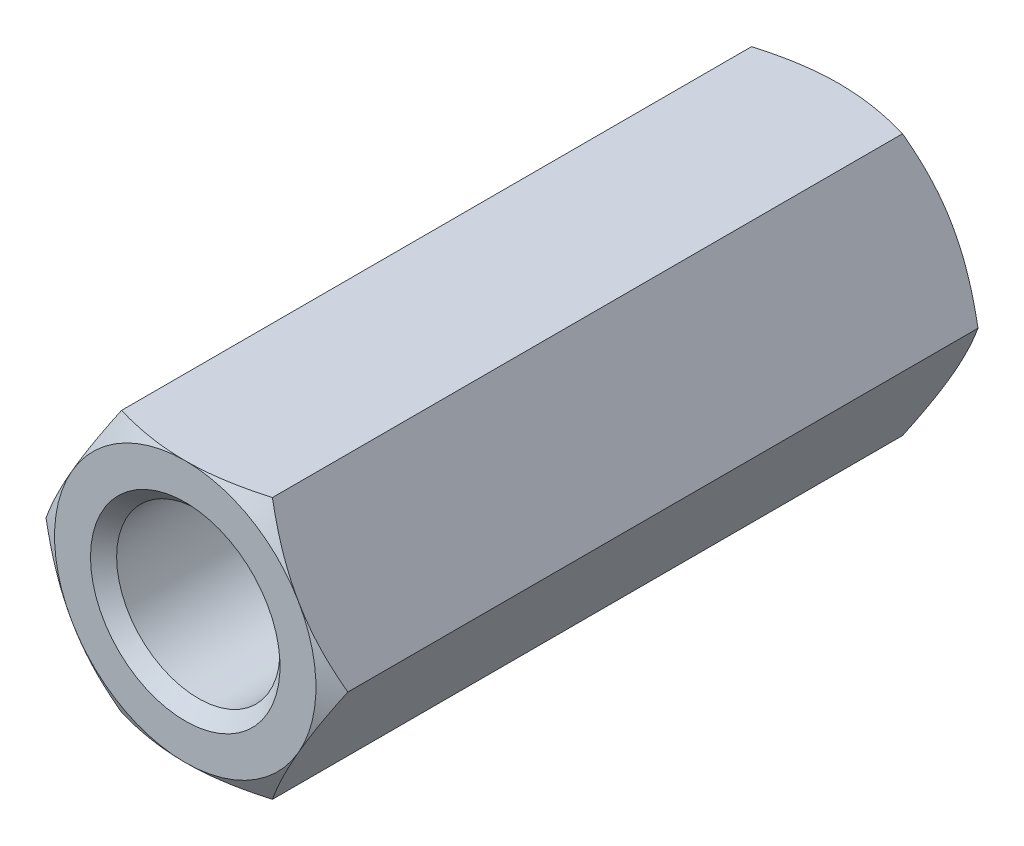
from build123d import *

# Parameters (mm, degrees)
BOSS_EXTRUDE1_DEPTH      = 10
SKETCH2_OUTSIDE_W        = 58.456
SKETCH2_OUTSIDE_H        = 57.218
SKETCH2_OUTSIDE_R        = 4
CUT_EXTRUDE1_DEPTH       = 12.718930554
CUT_EXTRUDE1_DRAFT       = -60
SKETCH3_R                = 2.5
SKETCH3_R_2              = 2.1
CUT_EXTRUDE2_DEPTH       = 10
SKETCH3_2_R              = 2.1
CUT_EXTRUDE3_DEPTH       = 11.2
CHAMFER1_SIZE            = 0.4
MIRROR1_COPY_1_SKETCH_W  = 58.456
MIRROR1_COPY_1_SKETCH_H  = 57.218
MIRROR1_COPY_1_SKETCH_R  = 4
MIRROR1_COPY_1_DEPTH     = 12.718930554
MIRROR1_COPY_1_DRAFT     = -60
CHAMFER1_OF_MIRROR1_SIZE = 0.4


with BuildPart() as part:
    # Sketch1 → Boss-Extrude1 (new body)
    with BuildSketch(Plane.XY):
        Polygon((2.309401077, 4), (-2.309401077, 4), (-4.618802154, 0), (-2.309401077, -4), (2.309401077, -4), (4.618802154, 0), align=None)
    boss_extrude1 = extrude(amount=-BOSS_EXTRUDE1_DEPTH)


with BuildPart() as cut_extrude1_tool:
    # Sketch2 outside → Cut-Extrude1 (with draft: the straight prism first)
    with BuildSketch(Plane(origin=(0, 0, -10), x_dir=(-1, 0, 0), z_dir=(0, 0, -1))):
        Rectangle(SKETCH2_OUTSIDE_W, SKETCH2_OUTSIDE_H)
        Circle(SKETCH2_OUTSIDE_R, mode=Mode.SUBTRACT)
    extrude(amount=-CUT_EXTRUDE1_DEPTH)
    # Cut-Extrude1: the draft: its side faces are tilted about the plane it starts from
    cut_extrude1_sides = [cut_extrude1_tool.faces().sort_by_distance(p)[0] for p in [
        (0, -28.609, -3.640534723),
        (-29.228, 0, -3.640534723),
        (0, 28.609, -3.640534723),
        (29.228, 0, -3.640534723),
        (4, 0, -3.640534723),
    ]]
    draft(cut_extrude1_sides, Plane(origin=(0, 0, -10), x_dir=(-1, 0, 0), z_dir=(0, 0, -1)), CUT_EXTRUDE1_DRAFT)


with BuildPart() as part_1:
    add(part.part)

    # Cut-Extrude1: cut by cut_extrude1_tool
    add(cut_extrude1_tool.part, mode=Mode.SUBTRACT)

    # Sketch3 → Cut-Extrude2 (cut)
    with BuildSketch(Plane(origin=(0, 0, -10), x_dir=(-1, 0, 0), z_dir=(0, 0, -1))):
        Circle(SKETCH3_R)
        Circle(SKETCH3_R_2, mode=Mode.SUBTRACT)
    cut_extrude2 = extrude(amount=-CUT_EXTRUDE2_DEPTH, mode=Mode.SUBTRACT)


with BuildPart() as cut_extrude2_piece_1:
    # of the separate pieces the step leaves, piece 1, a body of its own (cut_extrude2_pieces)
    add(part_1.part.solids().sort_by_distance((2.309401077, 4, 0))[0])

    # Chamfer1
    chamfer1_edges = [cut_extrude2_piece_1.edges().sort_by_distance(p)[0] for p in [
        (2.5, 0, -10),
    ]]
    chamfer(chamfer1_edges, length=CHAMFER1_SIZE)


with BuildPart() as cut_extrude2_piece_2:
    # of the separate pieces the step leaves, piece 2, a body of its own (cut_extrude2_pieces)
    add(part_1.part.solids().sort_by_distance((-2.1, 0, 0))[0])

    # Sketch3_2 → Cut-Extrude3 (cut)
    with BuildSketch(Plane(origin=(0, 0, -10), x_dir=(-1, 0, 0), z_dir=(0, 0, -1))):
        Circle(SKETCH3_2_R)
    cut_extrude3 = extrude(amount=-CUT_EXTRUDE3_DEPTH, mode=Mode.SUBTRACT)


with BuildPart() as cut_extrude2_piece_1_1:
    add(cut_extrude2_piece_1.part)

    # Mirror1: Boss-Extrude1, Cut-Extrude2, Cut-Extrude3 across plane
    add(boss_extrude1.mirror(Plane.XY))
    add(cut_extrude2.mirror(Plane.XY), mode=Mode.SUBTRACT)
    add(cut_extrude3.mirror(Plane.XY), mode=Mode.SUBTRACT)


with BuildPart() as mirror1_copy_1_tool:
    # Mirror1 copy 1 sketch → Mirror1 copy 1 (with draft: the straight prism first)
    with BuildSketch(Plane(origin=(0, 0, 10), x_dir=(-1, 0, 0), z_dir=(0, 0, 1))):
        Rectangle(MIRROR1_COPY_1_SKETCH_W, MIRROR1_COPY_1_SKETCH_H)
        Circle(MIRROR1_COPY_1_SKETCH_R, mode=Mode.SUBTRACT)
    extrude(amount=-MIRROR1_COPY_1_DEPTH)
    # Mirror1 copy 1: the draft: its side faces are tilted about the plane it starts from
    mirror1_copy_1_sides = [mirror1_copy_1_tool.faces().sort_by_distance(p)[0] for p in [
        (0, -28.609, 3.640534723),
        (-29.228, 0, 3.640534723),
        (0, 28.609, 3.640534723),
        (29.228, 0, 3.640534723),
        (4, 0, 3.640534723),
    ]]
    draft(mirror1_copy_1_sides, Plane(origin=(0, 0, 10), x_dir=(-1, 0, 0), z_dir=(0, 0, 1)), MIRROR1_COPY_1_DRAFT)


with BuildPart() as cut_extrude2_piece_1_2:
    add(cut_extrude2_piece_1_1.part)

    # Mirror1 copy 1: cut by mirror1_copy_1_tool
    add(mirror1_copy_1_tool.part, mode=Mode.SUBTRACT)

    # Chamfer1 of Mirror1
    chamfer1_of_mirror1_edges = [cut_extrude2_piece_1_2.edges().sort_by_distance(p)[0] for p in [
        (2.5, 0, 10),
    ]]
    chamfer(chamfer1_of_mirror1_edges, length=CHAMFER1_OF_MIRROR1_SIZE)


solid = cut_extrude2_piece_1_2.part
